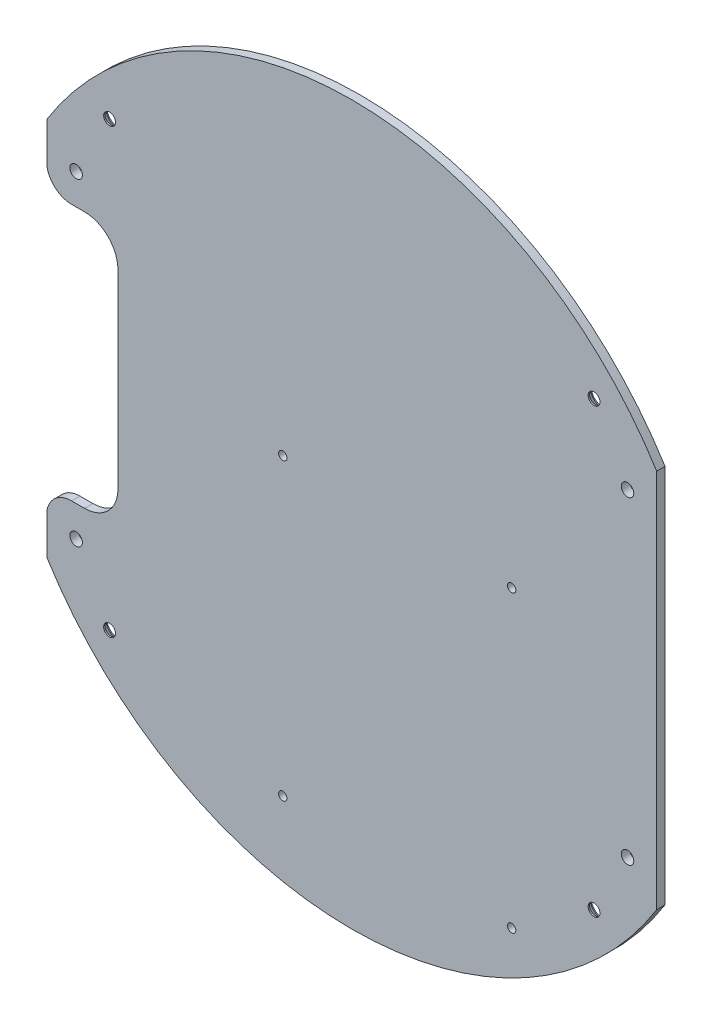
from build123d import *

# Parameters (mm, degrees)
BASE_EXTRUDE_DEPTH                            = 3.175
PASS_THRU_DEPTH                               = 138.013298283
SKETCH38_R                                    = 2.38125
F_8_MOUNT_HOLES_DEPTH                         = 232.192547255
SKETCH39_R                                    = 1.5875
RELAY_BOARD_DEPTH                             = 232.192547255
CSK_FOR_8_FLAT_HEAD_MACHINE_SCREW1_AT_2_COUNT = 2
CSK_FOR_8_FLAT_HEAD_MACHINE_SCREW1_AT_2_PITCH = 168.275
CSK_FOR_8_FLAT_HEAD_MACHINE_SCREW1_AT_3_COUNT = 2
CSK_FOR_8_FLAT_HEAD_MACHINE_SCREW1_AT_3_PITCH = 249.454801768
CSK_FOR_8_FLAT_HEAD_MACHINE_SCREW1_AT_4_COUNT = 2
CSK_FOR_8_FLAT_HEAD_MACHINE_SCREW1_AT_4_PITCH = 184.15


with BuildPart() as part:
    # Sketch1 → Base-Extrude (new body)
    with BuildSketch(Plane.XY):
        with BuildLine():
            Line((-115.8875, -63.5), (115.8875, -63.5))
            Line((115.8875, -63.5), (115.8875, 8.674531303))
            ThreePointArc((115.8875, 8.674531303), (0, 73.025), (-115.8875, 8.674531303))
            Line((-115.8875, 8.674531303), (-115.8875, -63.5))
        make_face()
    base_extrude = extrude(amount=BASE_EXTRUDE_DEPTH)

    # Sketch14 → Pass-Thru (cut, through all)
    with BuildSketch(Plane.XY.offset(3.175)):
        with BuildLine():
            Line((-116.044148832, -5.168468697), (-128.067064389, -5.168468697))
            Line((-128.067064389, -5.168468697), (-128.067064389, -87.981688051))
            Line((-128.067064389, -87.981688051), (-88.9, -87.981688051))
            Line((-88.9, -87.981688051), (-88.9, -27.393468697))
            ThreePointArc((-88.9, -27.393468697), (-92.619743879, -18.413212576), (-101.6, -14.693468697))
            Line((-101.6, -14.693468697), (-106.519148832, -14.693468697))
            ThreePointArc((-106.519148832, -14.693468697), (-113.254340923, -11.903660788), (-116.044148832, -5.168468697))
        make_face()
    pass_thru = extrude(amount=-PASS_THRU_DEPTH, mode=Mode.SUBTRACT)

    # Mirror2: Base-Extrude, Pass-Thru across plane
    add(base_extrude.mirror(Plane.ZX.offset(-63.5)))
    add(pass_thru.mirror(Plane.ZX.offset(-63.5)), mode=Mode.SUBTRACT)

    # Sketch38 → 8 Mount Holes (cut, through all)
    with BuildSketch(Plane.XY.offset(3.175)):
        with Locations((104.7939236, -2.9972)):
            Circle(SKETCH38_R)
        with Locations(Location((104.7939236, -124.0028, 0), (0, 0, 180))):
            Circle(SKETCH38_R)
        with Locations((-104.7939236, -124.0028)):
            Circle(SKETCH38_R)
        with Locations(Location((-104.7939236, -2.9972, 0), (0, 0, 180))):
            Circle(SKETCH38_R)
    extrude(amount=-F_8_MOUNT_HOLES_DEPTH, mode=Mode.SUBTRACT)

    # Sketch39 → Relay Board (cut, through all)
    with BuildSketch(Plane(origin=(0, 0, 0), x_dir=(-1, 0, 0), z_dir=(0, 0, -1))):
        with Locations(Location((26.2509, -169.291, 0), (0, 0, 90))):
            Circle(SKETCH39_R)
        with Locations(Location((26.2509, -57.277, 0), (0, 0, 90))):
            Circle(SKETCH39_R)
        with Locations(Location((-60.7441, -57.277, 0), (0, 0, 90))):
            Circle(SKETCH39_R)
        with Locations(Location((-60.7441, -169.291, 0), (0, 0, 90))):
            Circle(SKETCH39_R)
    extrude(amount=-RELAY_BOARD_DEPTH, mode=Mode.SUBTRACT)

    # Sketch41 → CSK for _8 Flat Head Machine Screw1 (revolve, cut)
    with BuildSketch(Plane(origin=(-92.075, -147.6375, 0), x_dir=(0, 1, 0), z_dir=(1, 0, 0))):
        Polygon((0, 0), (0, 3.175), (2.2479, 3.175), (2.2479, 2.64550021), (4.2164, 0.381), (4.2164, 0), align=None)
    csk_for_8_flat_head_machine_screw1 = revolve(axis=Axis((-92.075, -147.6375, -6.35), (0, 0, 1)), mode=Mode.SUBTRACT)

    # CSK for _8 Flat Head Machine Screw1 at 2: CSK for _8 Flat Head Machine Screw1 ×2
    with Locations(*[(0, i * CSK_FOR_8_FLAT_HEAD_MACHINE_SCREW1_AT_2_PITCH, 0) for i in range(1, CSK_FOR_8_FLAT_HEAD_MACHINE_SCREW1_AT_2_COUNT)]):
        add(csk_for_8_flat_head_machine_screw1, mode=Mode.SUBTRACT)

    # CSK for _8 Flat Head Machine Screw1 at 3: CSK for _8 Flat Head Machine Screw1 ×2
    with Locations(*[Vector(0.738209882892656, 0.6745710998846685, 0) * (i * CSK_FOR_8_FLAT_HEAD_MACHINE_SCREW1_AT_3_PITCH) for i in range(1, CSK_FOR_8_FLAT_HEAD_MACHINE_SCREW1_AT_3_COUNT)]):
        add(csk_for_8_flat_head_machine_screw1, mode=Mode.SUBTRACT)

    # CSK for _8 Flat Head Machine Screw1 at 4: CSK for _8 Flat Head Machine Screw1 ×2
    with Locations(*[(i * CSK_FOR_8_FLAT_HEAD_MACHINE_SCREW1_AT_4_PITCH, 0, 0) for i in range(1, CSK_FOR_8_FLAT_HEAD_MACHINE_SCREW1_AT_4_COUNT)]):
        add(csk_for_8_flat_head_machine_screw1, mode=Mode.SUBTRACT)


solid = part.part
